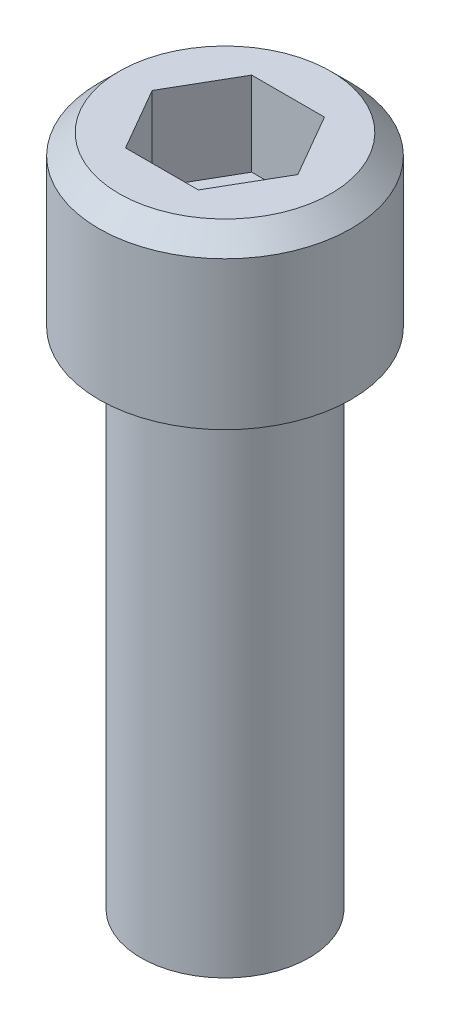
from build123d import *

# Parameters (mm, degrees)
CUT_EXTRUDE1_DEPTH = 6.35
CHAMFER1_SIZE      = 1.524


with BuildPart() as part:
    # Sketch1 → Base-Revolve (revolve)
    with BuildSketch(Plane.XY, mode=Mode.PRIVATE) as base_revolve_sk:
        Polygon((6.35, 0), (9.525, 0), (9.525, 12.7), (0, 12.7), (0, -38.1), (6.35, -38.1), align=None)
    revolve(base_revolve_sk.sketch.rotate(Axis((0, 0, 0), (0, 1, 0)), 90), axis=Axis((0, 0, 0), (0, 1, 0)))

    # Sketch2 → Cut-Extrude1 (cut)
    with BuildSketch(Plane(origin=(0, 12.7, 0), x_dir=(-1, 0, 0), z_dir=(0, 1, 0))):
        Polygon((2.749630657, -4.7625), (-2.749630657, -4.7625), (-5.499261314, 0), (-2.749630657, 4.7625), (2.749630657, 4.7625), (5.499261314, 0), align=None)
    extrude(amount=-CUT_EXTRUDE1_DEPTH, mode=Mode.SUBTRACT)

    # Chamfer1
    chamfer1_edges = [part.edges().sort_by_distance(p)[0] for p in [
        (0, 12.7, 9.525),
    ]]
    chamfer(chamfer1_edges, length=CHAMFER1_SIZE)


solid = part.part
